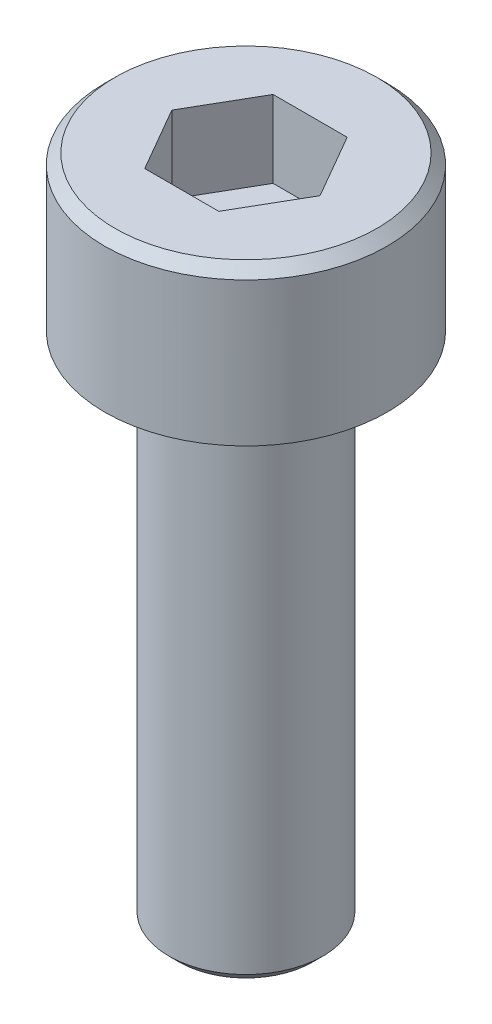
ISO-10303-21;
HEADER;
FILE_DESCRIPTION(('STEP AP214'),'2;1');
FILE_NAME('part.step','',(''),(''),'','','');
FILE_SCHEMA(('AUTOMOTIVE_DESIGN { 1 0 10303 214 1 1 1 1 }'));
ENDSEC;
DATA;
#1=APPLICATION_CONTEXT('core data for automotive mechanical design processes');
#2=APPLICATION_PROTOCOL_DEFINITION('international standard','automotive_design',2000,#1);
#3=PRODUCT_CONTEXT('',#1,'mechanical');
#4=PRODUCT('Part','Part','',(#3));
#5=PRODUCT_RELATED_PRODUCT_CATEGORY('part','',(#4));
#6=PRODUCT_DEFINITION_FORMATION('','',#4);
#7=PRODUCT_DEFINITION_CONTEXT('part definition',#1,'design');
#8=PRODUCT_DEFINITION('design','',#6,#7);
#9=PRODUCT_DEFINITION_SHAPE('','',#8);
#10=(LENGTH_UNIT() NAMED_UNIT(*) SI_UNIT(.MILLI.,.METRE.));
#11=(NAMED_UNIT(*) PLANE_ANGLE_UNIT() SI_UNIT($,.RADIAN.));
#12=(NAMED_UNIT(*) SI_UNIT($,.STERADIAN.) SOLID_ANGLE_UNIT());
#13=UNCERTAINTY_MEASURE_WITH_UNIT(LENGTH_MEASURE(1.E-05),#10,'distance_accuracy_value','');
#14=(GEOMETRIC_REPRESENTATION_CONTEXT(3) GLOBAL_UNCERTAINTY_ASSIGNED_CONTEXT((#13)) GLOBAL_UNIT_ASSIGNED_CONTEXT((#10,
#11,#12)) REPRESENTATION_CONTEXT('',''));
#15=CARTESIAN_POINT('',(0.,0.,0.));
#16=DIRECTION('',(0.,0.,1.));
#17=DIRECTION('',(1.,0.,0.));
#18=AXIS2_PLACEMENT_3D('',#15,#16,#17);
#19=CARTESIAN_POINT('',(10.352761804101,-9.,-38.63703305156));
#20=DIRECTION('',(0.,1.,0.));
#21=DIRECTION('',(0.,0.,-1.));
#22=AXIS2_PLACEMENT_3D('',#19,#20,#21);
#23=PLANE('',#22);
#24=CARTESIAN_POINT('',(10.352761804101,-9.,-38.63703305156));
#25=DIRECTION('',(0.,1.,0.));
#26=DIRECTION('',(0.,0.,1.));
#27=AXIS2_PLACEMENT_3D('',#24,#25,#26);
#28=CIRCLE('',#27,1.3);
#29=CARTESIAN_POINT('',(10.352761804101,-9.,-37.33703305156));
#30=VERTEX_POINT('',#29);
#31=EDGE_CURVE('E10',#30,#30,#28,.T.);
#32=ORIENTED_EDGE('',*,*,#31,.F.);
#33=EDGE_LOOP('',(#32));
#34=FACE_BOUND('',#33,.T.);
#35=ADVANCED_FACE('F16',(#34),#23,.F.);
#36=CARTESIAN_POINT('',(10.352761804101,-9.,-38.63703305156));
#37=DIRECTION('',(0.,1.,0.));
#38=DIRECTION('',(0.,0.,1.));
#39=AXIS2_PLACEMENT_3D('',#36,#37,#38);
#40=CONICAL_SURFACE('',#39,1.3,0.785398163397);
#41=CARTESIAN_POINT('',(10.352761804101,-8.8,-38.63703305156));
#42=DIRECTION('',(0.,1.,0.));
#43=DIRECTION('',(0.,0.,1.));
#44=AXIS2_PLACEMENT_3D('',#41,#42,#43);
#45=CIRCLE('',#44,1.5);
#46=CARTESIAN_POINT('',(10.352761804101,-8.8,-37.13703305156));
#47=VERTEX_POINT('',#46);
#48=EDGE_CURVE('E180',#47,#47,#45,.T.);
#49=ORIENTED_EDGE('',*,*,#48,.F.);
#50=DIRECTION('',(0.,0.707106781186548,0.707106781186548));
#51=VECTOR('',#50,1.);
#52=CARTESIAN_POINT('',(10.352761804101,-9.,-37.33703305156));
#53=LINE('',#52,#51);
#54=EDGE_CURVE('E27',#30,#47,#53,.T.);
#55=ORIENTED_EDGE('',*,*,#54,.F.);
#56=ORIENTED_EDGE('',*,*,#31,.T.);
#57=ORIENTED_EDGE('',*,*,#54,.T.);
#58=EDGE_LOOP('',(#49,#55,#56,#57));
#59=FACE_BOUND('',#58,.T.);
#60=ADVANCED_FACE('F287',(#59),#40,.T.);
#61=CARTESIAN_POINT('',(11.796137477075,2.5,-38.63703305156));
#62=DIRECTION('',(-0.866025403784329,0.,0.50000000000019));
#63=DIRECTION('',(0.,1.,0.));
#64=AXIS2_PLACEMENT_3D('',#61,#62,#63);
#65=PLANE('',#64);
#66=DIRECTION('',(0.50000000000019,0.,0.866025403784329));
#67=VECTOR('',#66,1.);
#68=CARTESIAN_POINT('',(11.796137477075,4.,-38.63703305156));
#69=LINE('',#68,#67);
#70=CARTESIAN_POINT('',(11.074449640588,4.,-39.88703305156));
#71=VERTEX_POINT('',#70);
#72=CARTESIAN_POINT('',(11.796137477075,4.,-38.63703305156));
#73=VERTEX_POINT('',#72);
#74=EDGE_CURVE('E147',#71,#73,#69,.T.);
#75=ORIENTED_EDGE('',*,*,#74,.F.);
#76=DIRECTION('',(0.,1.,0.));
#77=VECTOR('',#76,1.);
#78=CARTESIAN_POINT('',(11.074449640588,2.5,-39.88703305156));
#79=LINE('',#78,#77);
#80=CARTESIAN_POINT('',(11.074449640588,2.5,-39.88703305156));
#81=VERTEX_POINT('',#80);
#82=EDGE_CURVE('E186',#81,#71,#79,.T.);
#83=ORIENTED_EDGE('',*,*,#82,.F.);
#84=DIRECTION('',(0.50000000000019,0.,0.866025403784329));
#85=VECTOR('',#84,1.);
#86=CARTESIAN_POINT('',(11.796137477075,2.5,-38.63703305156));
#87=LINE('',#86,#85);
#88=CARTESIAN_POINT('',(11.796137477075,2.5,-38.63703305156));
#89=VERTEX_POINT('',#88);
#90=EDGE_CURVE('E190',#81,#89,#87,.T.);
#91=ORIENTED_EDGE('',*,*,#90,.T.);
#92=DIRECTION('',(0.,1.,0.));
#93=VECTOR('',#92,1.);
#94=CARTESIAN_POINT('',(11.796137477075,2.5,-38.63703305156));
#95=LINE('',#94,#93);
#96=EDGE_CURVE('E115',#89,#73,#95,.T.);
#97=ORIENTED_EDGE('',*,*,#96,.T.);
#98=EDGE_LOOP('',(#75,#83,#91,#97));
#99=FACE_BOUND('',#98,.T.);
#100=ADVANCED_FACE('F18',(#99),#65,.T.);
#101=CARTESIAN_POINT('',(11.074449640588,2.5,-37.38703305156));
#102=DIRECTION('',(-0.866025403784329,0.,-0.50000000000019));
#103=DIRECTION('',(-0.50000000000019,0.,0.866025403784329));
#104=AXIS2_PLACEMENT_3D('',#101,#102,#103);
#105=PLANE('',#104);
#106=DIRECTION('',(-0.50000000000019,0.,0.866025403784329));
#107=VECTOR('',#106,1.);
#108=CARTESIAN_POINT('',(11.074449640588,4.,-37.38703305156));
#109=LINE('',#108,#107);
#110=CARTESIAN_POINT('',(11.074449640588,4.,-37.38703305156));
#111=VERTEX_POINT('',#110);
#112=EDGE_CURVE('E125',#73,#111,#109,.T.);
#113=ORIENTED_EDGE('',*,*,#112,.F.);
#114=ORIENTED_EDGE('',*,*,#96,.F.);
#115=DIRECTION('',(-0.50000000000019,0.,0.866025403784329));
#116=VECTOR('',#115,1.);
#117=CARTESIAN_POINT('',(11.074449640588,2.5,-37.38703305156));
#118=LINE('',#117,#116);
#119=CARTESIAN_POINT('',(11.074449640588,2.5,-37.38703305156));
#120=VERTEX_POINT('',#119);
#121=EDGE_CURVE('E128',#89,#120,#118,.T.);
#122=ORIENTED_EDGE('',*,*,#121,.T.);
#123=DIRECTION('',(0.,1.,0.));
#124=VECTOR('',#123,1.);
#125=CARTESIAN_POINT('',(11.074449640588,2.5,-37.38703305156));
#126=LINE('',#125,#124);
#127=EDGE_CURVE('E121',#120,#111,#126,.T.);
#128=ORIENTED_EDGE('',*,*,#127,.T.);
#129=EDGE_LOOP('',(#113,#114,#122,#128));
#130=FACE_BOUND('',#129,.T.);
#131=ADVANCED_FACE('F123',(#130),#105,.T.);
#132=CARTESIAN_POINT('',(9.631073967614,2.5,-37.38703305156));
#133=DIRECTION('',(0.,0.,-1.));
#134=DIRECTION('',(0.,-1.,0.));
#135=AXIS2_PLACEMENT_3D('',#132,#133,#134);
#136=PLANE('',#135);
#137=DIRECTION('',(-1.,0.,0.));
#138=VECTOR('',#137,1.);
#139=CARTESIAN_POINT('',(9.631073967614,4.,-37.38703305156));
#140=LINE('',#139,#138);
#141=CARTESIAN_POINT('',(9.631073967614,4.,-37.38703305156));
#142=VERTEX_POINT('',#141);
#143=EDGE_CURVE('E136',#111,#142,#140,.T.);
#144=ORIENTED_EDGE('',*,*,#143,.F.);
#145=ORIENTED_EDGE('',*,*,#127,.F.);
#146=DIRECTION('',(-1.,0.,0.));
#147=VECTOR('',#146,1.);
#148=CARTESIAN_POINT('',(9.631073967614,2.5,-37.38703305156));
#149=LINE('',#148,#147);
#150=CARTESIAN_POINT('',(9.631073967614,2.5,-37.38703305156));
#151=VERTEX_POINT('',#150);
#152=EDGE_CURVE('E199',#120,#151,#149,.T.);
#153=ORIENTED_EDGE('',*,*,#152,.T.);
#154=DIRECTION('',(0.,1.,0.));
#155=VECTOR('',#154,1.);
#156=CARTESIAN_POINT('',(9.631073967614,2.5,-37.38703305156));
#157=LINE('',#156,#155);
#158=EDGE_CURVE('E133',#151,#142,#157,.T.);
#159=ORIENTED_EDGE('',*,*,#158,.T.);
#160=EDGE_LOOP('',(#144,#145,#153,#159));
#161=FACE_BOUND('',#160,.T.);
#162=ADVANCED_FACE('F137',(#161),#136,.T.);
#163=CARTESIAN_POINT('',(8.909386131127,2.5,-38.63703305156));
#164=DIRECTION('',(0.866025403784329,0.,-0.50000000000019));
#165=DIRECTION('',(0.,-1.,0.));
#166=AXIS2_PLACEMENT_3D('',#163,#164,#165);
#167=PLANE('',#166);
#168=DIRECTION('',(-0.50000000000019,0.,-0.866025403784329));
#169=VECTOR('',#168,1.);
#170=CARTESIAN_POINT('',(8.909386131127,4.,-38.63703305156));
#171=LINE('',#170,#169);
#172=CARTESIAN_POINT('',(8.909386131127,4.,-38.63703305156));
#173=VERTEX_POINT('',#172);
#174=EDGE_CURVE('E142',#142,#173,#171,.T.);
#175=ORIENTED_EDGE('',*,*,#174,.F.);
#176=ORIENTED_EDGE('',*,*,#158,.F.);
#177=DIRECTION('',(-0.50000000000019,0.,-0.866025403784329));
#178=VECTOR('',#177,1.);
#179=CARTESIAN_POINT('',(8.909386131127,2.5,-38.63703305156));
#180=LINE('',#179,#178);
#181=CARTESIAN_POINT('',(8.909386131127,2.5,-38.63703305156));
#182=VERTEX_POINT('',#181);
#183=EDGE_CURVE('E196',#151,#182,#180,.T.);
#184=ORIENTED_EDGE('',*,*,#183,.T.);
#185=DIRECTION('',(0.,1.,0.));
#186=VECTOR('',#185,1.);
#187=CARTESIAN_POINT('',(8.909386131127,2.5,-38.63703305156));
#188=LINE('',#187,#186);
#189=EDGE_CURVE('E197',#182,#173,#188,.T.);
#190=ORIENTED_EDGE('',*,*,#189,.T.);
#191=EDGE_LOOP('',(#175,#176,#184,#190));
#192=FACE_BOUND('',#191,.T.);
#193=ADVANCED_FACE('F231',(#192),#167,.T.);
#194=CARTESIAN_POINT('',(9.631073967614,2.5,-39.88703305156));
#195=DIRECTION('',(0.866025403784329,0.,0.50000000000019));
#196=DIRECTION('',(0.,-1.,0.));
#197=AXIS2_PLACEMENT_3D('',#194,#195,#196);
#198=PLANE('',#197);
#199=DIRECTION('',(0.50000000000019,0.,-0.866025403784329));
#200=VECTOR('',#199,1.);
#201=CARTESIAN_POINT('',(9.631073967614,4.,-39.88703305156));
#202=LINE('',#201,#200);
#203=CARTESIAN_POINT('',(9.631073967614,4.,-39.88703305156));
#204=VERTEX_POINT('',#203);
#205=EDGE_CURVE('E160',#173,#204,#202,.T.);
#206=ORIENTED_EDGE('',*,*,#205,.F.);
#207=ORIENTED_EDGE('',*,*,#189,.F.);
#208=DIRECTION('',(0.50000000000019,0.,-0.866025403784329));
#209=VECTOR('',#208,1.);
#210=CARTESIAN_POINT('',(9.631073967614,2.5,-39.88703305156));
#211=LINE('',#210,#209);
#212=CARTESIAN_POINT('',(9.631073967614,2.5,-39.88703305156));
#213=VERTEX_POINT('',#212);
#214=EDGE_CURVE('E192',#182,#213,#211,.T.);
#215=ORIENTED_EDGE('',*,*,#214,.T.);
#216=DIRECTION('',(0.,1.,0.));
#217=VECTOR('',#216,1.);
#218=CARTESIAN_POINT('',(9.631073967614,2.5,-39.88703305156));
#219=LINE('',#218,#217);
#220=EDGE_CURVE('E163',#213,#204,#219,.T.);
#221=ORIENTED_EDGE('',*,*,#220,.T.);
#222=EDGE_LOOP('',(#206,#207,#215,#221));
#223=FACE_BOUND('',#222,.T.);
#224=ADVANCED_FACE('F236',(#223),#198,.T.);
#225=CARTESIAN_POINT('',(10.352761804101,2.5,-38.63703305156));
#226=DIRECTION('',(0.,1.,0.));
#227=DIRECTION('',(0.,0.,-1.));
#228=AXIS2_PLACEMENT_3D('',#225,#226,#227);
#229=PLANE('',#228);
#230=ORIENTED_EDGE('',*,*,#121,.F.);
#231=ORIENTED_EDGE('',*,*,#90,.F.);
#232=DIRECTION('',(1.,0.,0.));
#233=VECTOR('',#232,1.);
#234=CARTESIAN_POINT('',(11.074449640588,2.5,-39.88703305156));
#235=LINE('',#234,#233);
#236=EDGE_CURVE('E166',#213,#81,#235,.T.);
#237=ORIENTED_EDGE('',*,*,#236,.F.);
#238=ORIENTED_EDGE('',*,*,#214,.F.);
#239=ORIENTED_EDGE('',*,*,#183,.F.);
#240=ORIENTED_EDGE('',*,*,#152,.F.);
#241=EDGE_LOOP('',(#230,#231,#237,#238,#239,#240));
#242=FACE_BOUND('',#241,.T.);
#243=ADVANCED_FACE('F244',(#242),#229,.T.);
#244=CARTESIAN_POINT('',(11.074449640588,2.5,-39.88703305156));
#245=DIRECTION('',(0.,0.,1.));
#246=DIRECTION('',(1.,0.,0.));
#247=AXIS2_PLACEMENT_3D('',#244,#245,#246);
#248=PLANE('',#247);
#249=DIRECTION('',(1.,0.,0.));
#250=VECTOR('',#249,1.);
#251=CARTESIAN_POINT('',(11.074449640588,4.,-39.88703305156));
#252=LINE('',#251,#250);
#253=EDGE_CURVE('E20',#204,#71,#252,.T.);
#254=ORIENTED_EDGE('',*,*,#253,.F.);
#255=ORIENTED_EDGE('',*,*,#220,.F.);
#256=ORIENTED_EDGE('',*,*,#236,.T.);
#257=ORIENTED_EDGE('',*,*,#82,.T.);
#258=EDGE_LOOP('',(#254,#255,#256,#257));
#259=FACE_BOUND('',#258,.T.);
#260=ADVANCED_FACE('F249',(#259),#248,.T.);
#261=CARTESIAN_POINT('',(10.352761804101,4.,-38.63703305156));
#262=DIRECTION('',(0.,1.,0.));
#263=DIRECTION('',(0.,0.,-1.));
#264=AXIS2_PLACEMENT_3D('',#261,#262,#263);
#265=PLANE('',#264);
#266=ORIENTED_EDGE('',*,*,#74,.T.);
#267=ORIENTED_EDGE('',*,*,#112,.T.);
#268=ORIENTED_EDGE('',*,*,#143,.T.);
#269=ORIENTED_EDGE('',*,*,#174,.T.);
#270=ORIENTED_EDGE('',*,*,#205,.T.);
#271=ORIENTED_EDGE('',*,*,#253,.T.);
#272=EDGE_LOOP('',(#266,#267,#268,#269,#270,#271));
#273=FACE_BOUND('',#272,.T.);
#274=CARTESIAN_POINT('',(10.352761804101,4.,-38.63703305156));
#275=DIRECTION('',(0.,-1.,0.));
#276=DIRECTION('',(0.,0.,-1.));
#277=AXIS2_PLACEMENT_3D('',#274,#275,#276);
#278=CIRCLE('',#277,2.55);
#279=CARTESIAN_POINT('',(10.352761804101,4.,-41.18703305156));
#280=VERTEX_POINT('',#279);
#281=EDGE_CURVE('E158',#280,#280,#278,.T.);
#282=ORIENTED_EDGE('',*,*,#281,.F.);
#283=EDGE_LOOP('',(#282));
#284=FACE_BOUND('',#283,.T.);
#285=ADVANCED_FACE('F144',(#273,#284),#265,.T.);
#286=CARTESIAN_POINT('',(10.352761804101,4.,-38.63703305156));
#287=DIRECTION('',(0.,-1.,0.));
#288=DIRECTION('',(0.,0.,-1.));
#289=AXIS2_PLACEMENT_3D('',#286,#287,#288);
#290=CONICAL_SURFACE('',#289,2.55,0.785398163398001);
#291=ORIENTED_EDGE('',*,*,#281,.T.);
#292=DIRECTION('',(0.,-0.707106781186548,-0.707106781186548));
#293=VECTOR('',#292,1.);
#294=CARTESIAN_POINT('',(10.352761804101,4.,-41.18703305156));
#295=LINE('',#294,#293);
#296=CARTESIAN_POINT('',(10.352761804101,3.8,-41.38703305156));
#297=VERTEX_POINT('',#296);
#298=EDGE_CURVE('E154',#280,#297,#295,.T.);
#299=ORIENTED_EDGE('',*,*,#298,.T.);
#300=CARTESIAN_POINT('',(10.352761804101,3.8,-38.63703305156));
#301=DIRECTION('',(0.,1.,0.));
#302=DIRECTION('',(0.,0.,1.));
#303=AXIS2_PLACEMENT_3D('',#300,#301,#302);
#304=CIRCLE('',#303,2.75);
#305=CARTESIAN_POINT('',(10.352761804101,3.8,-35.88703305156));
#306=VERTEX_POINT('',#305);
#307=EDGE_CURVE('E171',#297,#306,#304,.T.);
#308=ORIENTED_EDGE('',*,*,#307,.T.);
#309=CARTESIAN_POINT('',(10.352761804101,3.8,-38.63703305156));
#310=DIRECTION('',(0.,1.,0.));
#311=DIRECTION('',(0.,0.,1.));
#312=AXIS2_PLACEMENT_3D('',#309,#310,#311);
#313=CIRCLE('',#312,2.75);
#314=EDGE_CURVE('E175',#306,#297,#313,.T.);
#315=ORIENTED_EDGE('',*,*,#314,.T.);
#316=ORIENTED_EDGE('',*,*,#298,.F.);
#317=EDGE_LOOP('',(#291,#299,#308,#315,#316));
#318=FACE_BOUND('',#317,.T.);
#319=ADVANCED_FACE('F268',(#318),#290,.T.);
#320=CARTESIAN_POINT('',(10.352761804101,501.,-38.63703305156));
#321=DIRECTION('',(0.,1.,0.));
#322=DIRECTION('',(0.,0.,1.));
#323=AXIS2_PLACEMENT_3D('',#320,#321,#322);
#324=CYLINDRICAL_SURFACE('',#323,2.75);
#325=CARTESIAN_POINT('',(10.352761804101,1.,-38.63703305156));
#326=DIRECTION('',(0.,-1.,0.));
#327=DIRECTION('',(0.,0.,1.));
#328=AXIS2_PLACEMENT_3D('',#325,#326,#327);
#329=CIRCLE('',#328,2.75);
#330=CARTESIAN_POINT('',(10.352761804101,1.,-35.88703305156));
#331=VERTEX_POINT('',#330);
#332=EDGE_CURVE('E179',#331,#331,#329,.T.);
#333=ORIENTED_EDGE('',*,*,#332,.F.);
#334=DIRECTION('',(0.,1.,0.));
#335=VECTOR('',#334,1.);
#336=CARTESIAN_POINT('',(10.352761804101,501.,-35.88703305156));
#337=LINE('',#336,#335);
#338=EDGE_CURVE('E75',#331,#306,#337,.T.);
#339=ORIENTED_EDGE('',*,*,#338,.T.);
#340=ORIENTED_EDGE('',*,*,#307,.F.);
#341=ORIENTED_EDGE('',*,*,#314,.F.);
#342=ORIENTED_EDGE('',*,*,#338,.F.);
#343=EDGE_LOOP('',(#333,#339,#340,#341,#342));
#344=FACE_BOUND('',#343,.T.);
#345=ADVANCED_FACE('F214',(#344),#324,.T.);
#346=CARTESIAN_POINT('',(13.102761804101,1.,-38.63703305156));
#347=DIRECTION('',(0.,-1.,0.));
#348=DIRECTION('',(-1.,0.,0.));
#349=AXIS2_PLACEMENT_3D('',#346,#347,#348);
#350=PLANE('',#349);
#351=ORIENTED_EDGE('',*,*,#332,.T.);
#352=EDGE_LOOP('',(#351));
#353=FACE_BOUND('',#352,.T.);
#354=CARTESIAN_POINT('',(10.352761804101,1.,-38.63703305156));
#355=DIRECTION('',(0.,-1.,0.));
#356=DIRECTION('',(0.,0.,1.));
#357=AXIS2_PLACEMENT_3D('',#354,#355,#356);
#358=CIRCLE('',#357,1.5);
#359=CARTESIAN_POINT('',(10.352761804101,1.,-37.13703305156));
#360=VERTEX_POINT('',#359);
#361=EDGE_CURVE('E176',#360,#360,#358,.T.);
#362=ORIENTED_EDGE('',*,*,#361,.F.);
#363=EDGE_LOOP('',(#362));
#364=FACE_BOUND('',#363,.T.);
#365=ADVANCED_FACE('F208',(#353,#364),#350,.T.);
#366=CARTESIAN_POINT('',(10.352761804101,501.,-38.63703305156));
#367=DIRECTION('',(0.,1.,0.));
#368=DIRECTION('',(0.,0.,1.));
#369=AXIS2_PLACEMENT_3D('',#366,#367,#368);
#370=CYLINDRICAL_SURFACE('',#369,1.5);
#371=DIRECTION('',(0.,-1.,0.));
#372=VECTOR('',#371,1.);
#373=CARTESIAN_POINT('',(10.352761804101,1.,-37.13703305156));
#374=LINE('',#373,#372);
#375=EDGE_CURVE('E357',#360,#47,#374,.T.);
#376=ORIENTED_EDGE('',*,*,#375,.T.);
#377=ORIENTED_EDGE('',*,*,#48,.T.);
#378=ORIENTED_EDGE('',*,*,#375,.F.);
#379=ORIENTED_EDGE('',*,*,#361,.T.);
#380=EDGE_LOOP('',(#376,#377,#378,#379));
#381=FACE_BOUND('',#380,.T.);
#382=ADVANCED_FACE('F213',(#381),#370,.T.);
#383=CLOSED_SHELL('',(#35,#60,#100,#131,#162,#193,#224,#243,#260,#285,#319,#345,#365,#382));
#384=MANIFOLD_SOLID_BREP('B1',#383);
#385=ADVANCED_BREP_SHAPE_REPRESENTATION('',(#18,#384),#14);
#386=SHAPE_DEFINITION_REPRESENTATION(#9,#385);
ENDSEC;
END-ISO-10303-21;
